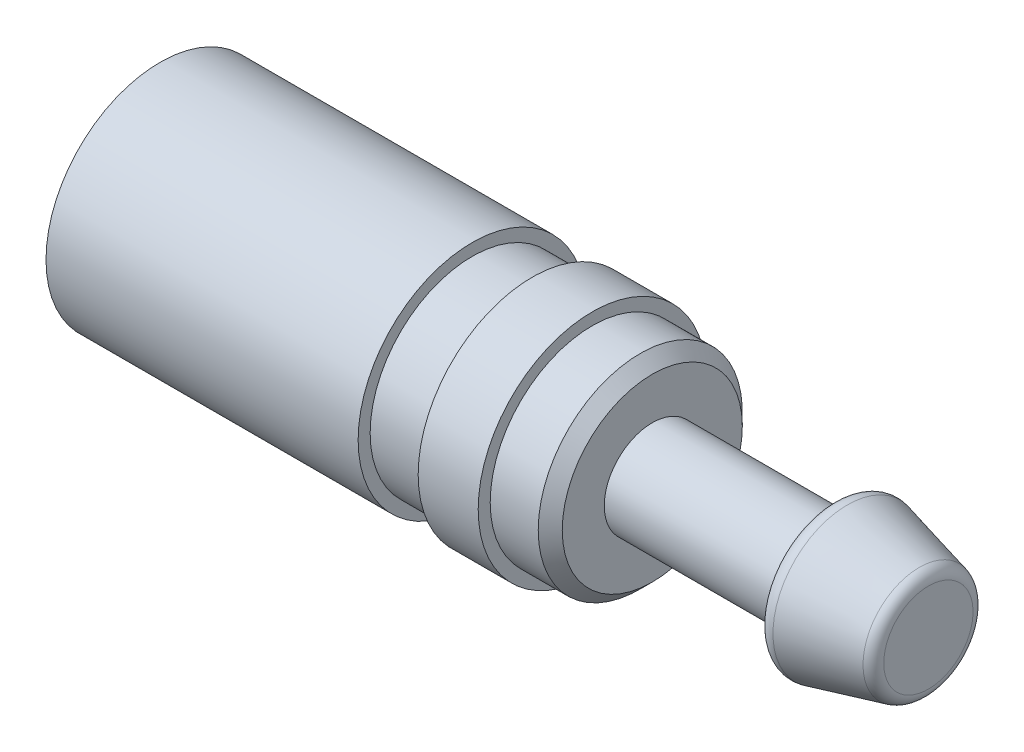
ISO-10303-21;
HEADER;
FILE_DESCRIPTION(('STEP AP214'),'2;1');
FILE_NAME('part.step','',(''),(''),'','','');
FILE_SCHEMA(('AUTOMOTIVE_DESIGN { 1 0 10303 214 1 1 1 1 }'));
ENDSEC;
DATA;
#1=APPLICATION_CONTEXT('core data for automotive mechanical design processes');
#2=APPLICATION_PROTOCOL_DEFINITION('international standard','automotive_design',2000,#1);
#3=PRODUCT_CONTEXT('',#1,'mechanical');
#4=PRODUCT('Part','Part','',(#3));
#5=PRODUCT_RELATED_PRODUCT_CATEGORY('part','',(#4));
#6=PRODUCT_DEFINITION_FORMATION('','',#4);
#7=PRODUCT_DEFINITION_CONTEXT('part definition',#1,'design');
#8=PRODUCT_DEFINITION('design','',#6,#7);
#9=PRODUCT_DEFINITION_SHAPE('','',#8);
#10=(LENGTH_UNIT() NAMED_UNIT(*) SI_UNIT(.MILLI.,.METRE.));
#11=(NAMED_UNIT(*) PLANE_ANGLE_UNIT() SI_UNIT($,.RADIAN.));
#12=(NAMED_UNIT(*) SI_UNIT($,.STERADIAN.) SOLID_ANGLE_UNIT());
#13=UNCERTAINTY_MEASURE_WITH_UNIT(LENGTH_MEASURE(1.E-05),#10,'distance_accuracy_value','');
#14=(GEOMETRIC_REPRESENTATION_CONTEXT(3) GLOBAL_UNCERTAINTY_ASSIGNED_CONTEXT((#13)) GLOBAL_UNIT_ASSIGNED_CONTEXT((#10,
#11,#12)) REPRESENTATION_CONTEXT('',''));
#15=CARTESIAN_POINT('',(0.,0.,0.));
#16=DIRECTION('',(0.,0.,1.));
#17=DIRECTION('',(1.,0.,0.));
#18=AXIS2_PLACEMENT_3D('',#15,#16,#17);
#19=CARTESIAN_POINT('',(64.,0.,0.));
#20=DIRECTION('',(-1.,0.,0.));
#21=DIRECTION('',(0.,0.,1.));
#22=AXIS2_PLACEMENT_3D('',#19,#20,#21);
#23=PLANE('',#22);
#24=CARTESIAN_POINT('',(64.,0.,0.));
#25=DIRECTION('',(-1.,0.,0.));
#26=DIRECTION('',(0.,0.,1.));
#27=AXIS2_PLACEMENT_3D('',#24,#25,#26);
#28=CIRCLE('',#27,3.71922359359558);
#29=CARTESIAN_POINT('',(64.,0.,3.71922359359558));
#30=VERTEX_POINT('',#29);
#31=EDGE_CURVE('E46',#30,#30,#28,.F.);
#32=ORIENTED_EDGE('',*,*,#31,.T.);
#33=EDGE_LOOP('',(#32));
#34=FACE_BOUND('',#33,.T.);
#35=ADVANCED_FACE('F31',(#34),#23,.F.);
#36=CARTESIAN_POINT('',(64.,0.,0.));
#37=DIRECTION('',(-1.,0.,0.));
#38=DIRECTION('',(0.,0.,1.));
#39=AXIS2_PLACEMENT_3D('',#36,#37,#38);
#40=CONICAL_SURFACE('',#39,4.5,0.244978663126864);
#41=CARTESIAN_POINT('',(63.2425356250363,0.,0.));
#42=DIRECTION('',(1.,0.,0.));
#43=DIRECTION('',(0.,0.,-1.));
#44=AXIS2_PLACEMENT_3D('',#41,#42,#43);
#45=CIRCLE('',#44,4.68936609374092);
#46=CARTESIAN_POINT('',(63.2425356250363,0.,-4.68936609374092));
#47=VERTEX_POINT('',#46);
#48=EDGE_CURVE('E51',#47,#47,#45,.F.);
#49=ORIENTED_EDGE('',*,*,#48,.T.);
#50=EDGE_LOOP('',(#49));
#51=FACE_BOUND('',#50,.T.);
#52=CARTESIAN_POINT('',(57.2425356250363,0.,0.));
#53=DIRECTION('',(1.,0.,0.));
#54=DIRECTION('',(0.,0.,-1.));
#55=AXIS2_PLACEMENT_3D('',#52,#53,#54);
#56=CIRCLE('',#55,6.18936609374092);
#57=CARTESIAN_POINT('',(57.2425356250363,0.,-6.18936609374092));
#58=VERTEX_POINT('',#57);
#59=EDGE_CURVE('E54',#58,#58,#56,.T.);
#60=ORIENTED_EDGE('',*,*,#59,.T.);
#61=EDGE_LOOP('',(#60));
#62=FACE_BOUND('',#61,.T.);
#63=ADVANCED_FACE('F133',(#51,#62),#40,.T.);
#64=CARTESIAN_POINT('',(56.,4.,0.));
#65=DIRECTION('',(1.,0.,0.));
#66=DIRECTION('',(0.,0.,-1.));
#67=AXIS2_PLACEMENT_3D('',#64,#65,#66);
#68=PLANE('',#67);
#69=CARTESIAN_POINT('',(56.,0.,0.));
#70=DIRECTION('',(1.,0.,0.));
#71=DIRECTION('',(0.,0.,-1.));
#72=AXIS2_PLACEMENT_3D('',#69,#70,#71);
#73=CIRCLE('',#72,5.21922359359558);
#74=CARTESIAN_POINT('',(56.,0.,-5.21922359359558));
#75=VERTEX_POINT('',#74);
#76=EDGE_CURVE('E42',#75,#75,#73,.F.);
#77=ORIENTED_EDGE('',*,*,#76,.T.);
#78=EDGE_LOOP('',(#77));
#79=FACE_BOUND('',#78,.T.);
#80=CARTESIAN_POINT('',(56.,0.,0.));
#81=DIRECTION('',(-1.,0.,0.));
#82=DIRECTION('',(0.,0.,1.));
#83=AXIS2_PLACEMENT_3D('',#80,#81,#82);
#84=CIRCLE('',#83,4.);
#85=CARTESIAN_POINT('',(56.,0.,4.));
#86=VERTEX_POINT('',#85);
#87=EDGE_CURVE('E57',#86,#86,#84,.T.);
#88=ORIENTED_EDGE('',*,*,#87,.F.);
#89=EDGE_LOOP('',(#88));
#90=FACE_BOUND('',#89,.T.);
#91=ADVANCED_FACE('F139',(#79,#90),#68,.F.);
#92=CARTESIAN_POINT('',(0.,0.,0.));
#93=DIRECTION('',(-1.,0.,0.));
#94=DIRECTION('',(0.,0.,1.));
#95=AXIS2_PLACEMENT_3D('',#92,#93,#94);
#96=CYLINDRICAL_SURFACE('',#95,4.);
#97=CARTESIAN_POINT('',(41.,0.,0.));
#98=DIRECTION('',(-1.,0.,0.));
#99=DIRECTION('',(0.,0.,1.));
#100=AXIS2_PLACEMENT_3D('',#97,#98,#99);
#101=CIRCLE('',#100,4.);
#102=CARTESIAN_POINT('',(41.,0.,4.));
#103=VERTEX_POINT('',#102);
#104=EDGE_CURVE('E60',#103,#103,#101,.T.);
#105=ORIENTED_EDGE('',*,*,#104,.F.);
#106=EDGE_LOOP('',(#105));
#107=FACE_BOUND('',#106,.T.);
#108=ORIENTED_EDGE('',*,*,#87,.T.);
#109=EDGE_LOOP('',(#108));
#110=FACE_BOUND('',#109,.T.);
#111=ADVANCED_FACE('F130',(#107,#110),#96,.T.);
#112=CARTESIAN_POINT('',(41.,8.5,0.));
#113=DIRECTION('',(-1.,0.,0.));
#114=DIRECTION('',(0.,0.,1.));
#115=AXIS2_PLACEMENT_3D('',#112,#113,#114);
#116=PLANE('',#115);
#117=CARTESIAN_POINT('',(41.,0.,0.));
#118=DIRECTION('',(-1.,0.,0.));
#119=DIRECTION('',(0.,0.,1.));
#120=AXIS2_PLACEMENT_3D('',#117,#118,#119);
#121=CIRCLE('',#120,7.49999999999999);
#122=CARTESIAN_POINT('',(41.,0.,7.49999999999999));
#123=VERTEX_POINT('',#122);
#124=EDGE_CURVE('E10',#123,#123,#121,.F.);
#125=ORIENTED_EDGE('',*,*,#124,.T.);
#126=EDGE_LOOP('',(#125));
#127=FACE_BOUND('',#126,.T.);
#128=ORIENTED_EDGE('',*,*,#104,.T.);
#129=EDGE_LOOP('',(#128));
#130=FACE_BOUND('',#129,.T.);
#131=ADVANCED_FACE('F125',(#127,#130),#116,.F.);
#132=CARTESIAN_POINT('',(0.,0.,0.));
#133=DIRECTION('',(-1.,0.,0.));
#134=DIRECTION('',(0.,0.,1.));
#135=AXIS2_PLACEMENT_3D('',#132,#133,#134);
#136=CYLINDRICAL_SURFACE('',#135,8.5);
#137=CARTESIAN_POINT('',(40.,0.,0.));
#138=DIRECTION('',(-1.,0.,0.));
#139=DIRECTION('',(0.,0.,1.));
#140=AXIS2_PLACEMENT_3D('',#137,#138,#139);
#141=CIRCLE('',#140,8.5);
#142=CARTESIAN_POINT('',(40.,0.,8.5));
#143=VERTEX_POINT('',#142);
#144=EDGE_CURVE('E38',#143,#143,#141,.T.);
#145=ORIENTED_EDGE('',*,*,#144,.T.);
#146=EDGE_LOOP('',(#145));
#147=FACE_BOUND('',#146,.T.);
#148=CARTESIAN_POINT('',(36.,0.,0.));
#149=DIRECTION('',(-1.,0.,0.));
#150=DIRECTION('',(0.,0.,1.));
#151=AXIS2_PLACEMENT_3D('',#148,#149,#150);
#152=CIRCLE('',#151,8.5);
#153=CARTESIAN_POINT('',(36.,0.,8.5));
#154=VERTEX_POINT('',#153);
#155=EDGE_CURVE('E63',#154,#154,#152,.T.);
#156=ORIENTED_EDGE('',*,*,#155,.F.);
#157=EDGE_LOOP('',(#156));
#158=FACE_BOUND('',#157,.T.);
#159=ADVANCED_FACE('F120',(#147,#158),#136,.T.);
#160=CARTESIAN_POINT('',(36.,9.5,0.));
#161=DIRECTION('',(-1.,0.,0.));
#162=DIRECTION('',(0.,0.,1.));
#163=AXIS2_PLACEMENT_3D('',#160,#161,#162);
#164=PLANE('',#163);
#165=CARTESIAN_POINT('',(36.,0.,0.));
#166=DIRECTION('',(-1.,0.,0.));
#167=DIRECTION('',(0.,0.,1.));
#168=AXIS2_PLACEMENT_3D('',#165,#166,#167);
#169=CIRCLE('',#168,9.5);
#170=CARTESIAN_POINT('',(36.,0.,9.5));
#171=VERTEX_POINT('',#170);
#172=EDGE_CURVE('E66',#171,#171,#169,.T.);
#173=ORIENTED_EDGE('',*,*,#172,.F.);
#174=EDGE_LOOP('',(#173));
#175=FACE_BOUND('',#174,.T.);
#176=ORIENTED_EDGE('',*,*,#155,.T.);
#177=EDGE_LOOP('',(#176));
#178=FACE_BOUND('',#177,.T.);
#179=ADVANCED_FACE('F114',(#175,#178),#164,.F.);
#180=CARTESIAN_POINT('',(0.,0.,0.));
#181=DIRECTION('',(-1.,0.,0.));
#182=DIRECTION('',(0.,0.,1.));
#183=AXIS2_PLACEMENT_3D('',#180,#181,#182);
#184=CYLINDRICAL_SURFACE('',#183,9.5);
#185=CARTESIAN_POINT('',(31.,0.,0.));
#186=DIRECTION('',(-1.,0.,0.));
#187=DIRECTION('',(0.,0.,1.));
#188=AXIS2_PLACEMENT_3D('',#185,#186,#187);
#189=CIRCLE('',#188,9.5);
#190=CARTESIAN_POINT('',(31.,0.,9.5));
#191=VERTEX_POINT('',#190);
#192=EDGE_CURVE('E69',#191,#191,#189,.T.);
#193=ORIENTED_EDGE('',*,*,#192,.F.);
#194=EDGE_LOOP('',(#193));
#195=FACE_BOUND('',#194,.T.);
#196=ORIENTED_EDGE('',*,*,#172,.T.);
#197=EDGE_LOOP('',(#196));
#198=FACE_BOUND('',#197,.T.);
#199=ADVANCED_FACE('F108',(#195,#198),#184,.T.);
#200=CARTESIAN_POINT('',(31.,8.5,0.));
#201=DIRECTION('',(1.,0.,0.));
#202=DIRECTION('',(0.,0.,-1.));
#203=AXIS2_PLACEMENT_3D('',#200,#201,#202);
#204=PLANE('',#203);
#205=CARTESIAN_POINT('',(31.,0.,0.));
#206=DIRECTION('',(-1.,0.,0.));
#207=DIRECTION('',(0.,0.,1.));
#208=AXIS2_PLACEMENT_3D('',#205,#206,#207);
#209=CIRCLE('',#208,8.5);
#210=CARTESIAN_POINT('',(31.,0.,8.5));
#211=VERTEX_POINT('',#210);
#212=EDGE_CURVE('E72',#211,#211,#209,.T.);
#213=ORIENTED_EDGE('',*,*,#212,.F.);
#214=EDGE_LOOP('',(#213));
#215=FACE_BOUND('',#214,.T.);
#216=ORIENTED_EDGE('',*,*,#192,.T.);
#217=EDGE_LOOP('',(#216));
#218=FACE_BOUND('',#217,.T.);
#219=ADVANCED_FACE('F102',(#215,#218),#204,.F.);
#220=CARTESIAN_POINT('',(0.,0.,0.));
#221=DIRECTION('',(-1.,0.,0.));
#222=DIRECTION('',(0.,0.,1.));
#223=AXIS2_PLACEMENT_3D('',#220,#221,#222);
#224=CYLINDRICAL_SURFACE('',#223,8.5);
#225=CARTESIAN_POINT('',(26.,0.,0.));
#226=DIRECTION('',(-1.,0.,0.));
#227=DIRECTION('',(0.,0.,1.));
#228=AXIS2_PLACEMENT_3D('',#225,#226,#227);
#229=CIRCLE('',#228,8.5);
#230=CARTESIAN_POINT('',(26.,0.,8.5));
#231=VERTEX_POINT('',#230);
#232=EDGE_CURVE('E75',#231,#231,#229,.T.);
#233=ORIENTED_EDGE('',*,*,#232,.F.);
#234=EDGE_LOOP('',(#233));
#235=FACE_BOUND('',#234,.T.);
#236=ORIENTED_EDGE('',*,*,#212,.T.);
#237=EDGE_LOOP('',(#236));
#238=FACE_BOUND('',#237,.T.);
#239=ADVANCED_FACE('F96',(#235,#238),#224,.T.);
#240=CARTESIAN_POINT('',(26.,9.5,0.));
#241=DIRECTION('',(-1.,0.,0.));
#242=DIRECTION('',(0.,0.,1.));
#243=AXIS2_PLACEMENT_3D('',#240,#241,#242);
#244=PLANE('',#243);
#245=CARTESIAN_POINT('',(26.,0.,0.));
#246=DIRECTION('',(-1.,0.,0.));
#247=DIRECTION('',(0.,0.,1.));
#248=AXIS2_PLACEMENT_3D('',#245,#246,#247);
#249=CIRCLE('',#248,9.5);
#250=CARTESIAN_POINT('',(26.,0.,9.5));
#251=VERTEX_POINT('',#250);
#252=EDGE_CURVE('E78',#251,#251,#249,.T.);
#253=ORIENTED_EDGE('',*,*,#252,.F.);
#254=EDGE_LOOP('',(#253));
#255=FACE_BOUND('',#254,.T.);
#256=ORIENTED_EDGE('',*,*,#232,.T.);
#257=EDGE_LOOP('',(#256));
#258=FACE_BOUND('',#257,.T.);
#259=ADVANCED_FACE('F90',(#255,#258),#244,.F.);
#260=CARTESIAN_POINT('',(0.,0.,0.));
#261=DIRECTION('',(-1.,0.,0.));
#262=DIRECTION('',(0.,0.,1.));
#263=AXIS2_PLACEMENT_3D('',#260,#261,#262);
#264=CYLINDRICAL_SURFACE('',#263,9.5);
#265=CARTESIAN_POINT('',(0.,0.,0.));
#266=DIRECTION('',(-1.,0.,0.));
#267=DIRECTION('',(0.,0.,1.));
#268=AXIS2_PLACEMENT_3D('',#265,#266,#267);
#269=CIRCLE('',#268,9.5);
#270=CARTESIAN_POINT('',(0.,0.,9.5));
#271=VERTEX_POINT('',#270);
#272=EDGE_CURVE('E81',#271,#271,#269,.T.);
#273=ORIENTED_EDGE('',*,*,#272,.F.);
#274=EDGE_LOOP('',(#273));
#275=FACE_BOUND('',#274,.T.);
#276=ORIENTED_EDGE('',*,*,#252,.T.);
#277=EDGE_LOOP('',(#276));
#278=FACE_BOUND('',#277,.T.);
#279=ADVANCED_FACE('F87',(#275,#278),#264,.T.);
#280=CARTESIAN_POINT('',(0.,0.,0.));
#281=DIRECTION('',(1.,0.,0.));
#282=DIRECTION('',(0.,0.,-1.));
#283=AXIS2_PLACEMENT_3D('',#280,#281,#282);
#284=PLANE('',#283);
#285=ORIENTED_EDGE('',*,*,#272,.T.);
#286=EDGE_LOOP('',(#285));
#287=FACE_BOUND('',#286,.T.);
#288=ADVANCED_FACE('F85',(#287),#284,.F.);
#289=CARTESIAN_POINT('',(63.,0.,0.));
#290=DIRECTION('',(-1.,0.,0.));
#291=DIRECTION('',(0.,0.,1.));
#292=AXIS2_PLACEMENT_3D('',#289,#290,#291);
#293=TOROIDAL_SURFACE('',#292,3.71922359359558,1.);
#294=ORIENTED_EDGE('',*,*,#31,.F.);
#295=EDGE_LOOP('',(#294));
#296=FACE_BOUND('',#295,.T.);
#297=ORIENTED_EDGE('',*,*,#48,.F.);
#298=EDGE_LOOP('',(#297));
#299=FACE_BOUND('',#298,.T.);
#300=ADVANCED_FACE('F144',(#296,#299),#293,.T.);
#301=CARTESIAN_POINT('',(57.,0.,0.));
#302=DIRECTION('',(1.,0.,0.));
#303=DIRECTION('',(0.,0.,-1.));
#304=AXIS2_PLACEMENT_3D('',#301,#302,#303);
#305=TOROIDAL_SURFACE('',#304,5.21922359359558,1.);
#306=ORIENTED_EDGE('',*,*,#59,.F.);
#307=EDGE_LOOP('',(#306));
#308=FACE_BOUND('',#307,.T.);
#309=ORIENTED_EDGE('',*,*,#76,.F.);
#310=EDGE_LOOP('',(#309));
#311=FACE_BOUND('',#310,.T.);
#312=ADVANCED_FACE('F146',(#308,#311),#305,.T.);
#313=CARTESIAN_POINT('',(40.,0.,0.));
#314=DIRECTION('',(-1.,0.,0.));
#315=DIRECTION('',(0.,0.,1.));
#316=AXIS2_PLACEMENT_3D('',#313,#314,#315);
#317=CONICAL_SURFACE('',#316,8.5,0.785398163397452);
#318=ORIENTED_EDGE('',*,*,#124,.F.);
#319=EDGE_LOOP('',(#318));
#320=FACE_BOUND('',#319,.T.);
#321=ORIENTED_EDGE('',*,*,#144,.F.);
#322=EDGE_LOOP('',(#321));
#323=FACE_BOUND('',#322,.T.);
#324=ADVANCED_FACE('F33',(#320,#323),#317,.T.);
#325=CLOSED_SHELL('',(#35,#63,#91,#111,#131,#159,#179,#199,#219,#239,#259,#279,#288,#300,#312,#324));
#326=MANIFOLD_SOLID_BREP('B2',#325);
#327=ADVANCED_BREP_SHAPE_REPRESENTATION('',(#18,#326),#14);
#328=SHAPE_DEFINITION_REPRESENTATION(#9,#327);
ENDSEC;
END-ISO-10303-21;
